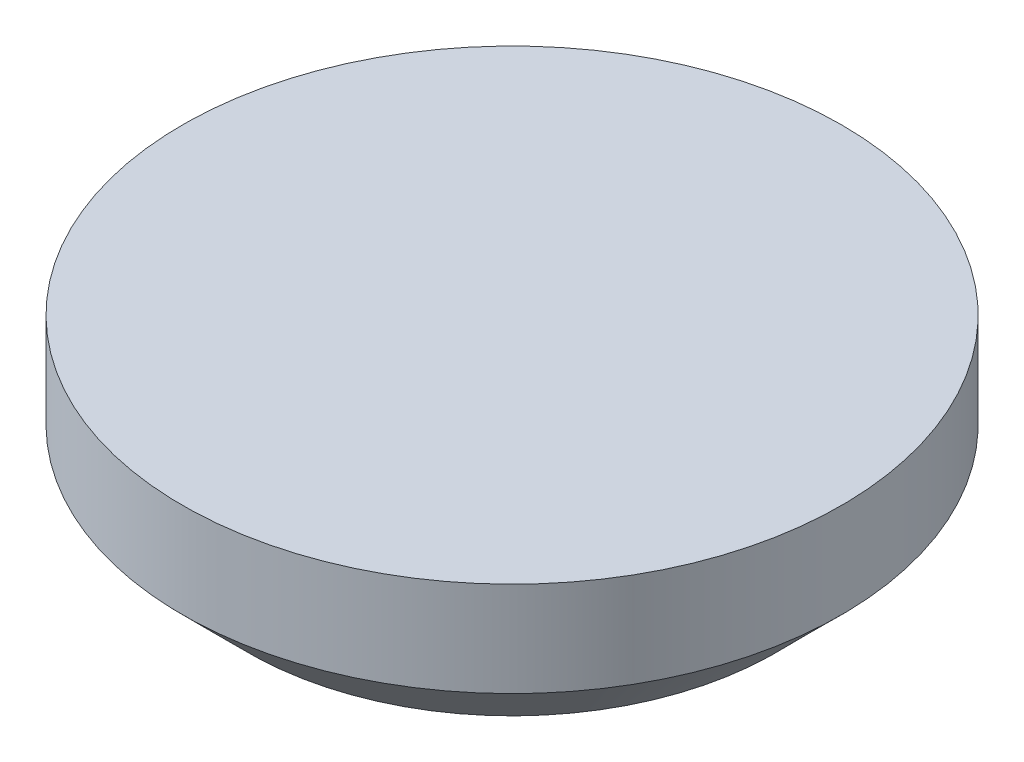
ISO-10303-21;
HEADER;
FILE_DESCRIPTION(('STEP AP214'),'2;1');
FILE_NAME('part.step','',(''),(''),'','','');
FILE_SCHEMA(('AUTOMOTIVE_DESIGN { 1 0 10303 214 1 1 1 1 }'));
ENDSEC;
DATA;
#1=APPLICATION_CONTEXT('core data for automotive mechanical design processes');
#2=APPLICATION_PROTOCOL_DEFINITION('international standard','automotive_design',2000,#1);
#3=PRODUCT_CONTEXT('',#1,'mechanical');
#4=PRODUCT('Part','Part','',(#3));
#5=PRODUCT_RELATED_PRODUCT_CATEGORY('part','',(#4));
#6=PRODUCT_DEFINITION_FORMATION('','',#4);
#7=PRODUCT_DEFINITION_CONTEXT('part definition',#1,'design');
#8=PRODUCT_DEFINITION('design','',#6,#7);
#9=PRODUCT_DEFINITION_SHAPE('','',#8);
#10=(LENGTH_UNIT() NAMED_UNIT(*) SI_UNIT(.MILLI.,.METRE.));
#11=(NAMED_UNIT(*) PLANE_ANGLE_UNIT() SI_UNIT($,.RADIAN.));
#12=(NAMED_UNIT(*) SI_UNIT($,.STERADIAN.) SOLID_ANGLE_UNIT());
#13=UNCERTAINTY_MEASURE_WITH_UNIT(LENGTH_MEASURE(1.E-05),#10,'distance_accuracy_value','');
#14=(GEOMETRIC_REPRESENTATION_CONTEXT(3) GLOBAL_UNCERTAINTY_ASSIGNED_CONTEXT((#13)) GLOBAL_UNIT_ASSIGNED_CONTEXT((#10,
#11,#12)) REPRESENTATION_CONTEXT('',''));
#15=CARTESIAN_POINT('',(0.,0.,0.));
#16=DIRECTION('',(0.,0.,1.));
#17=DIRECTION('',(1.,0.,0.));
#18=AXIS2_PLACEMENT_3D('',#15,#16,#17);
#19=CARTESIAN_POINT('',(0.,390.,0.));
#20=DIRECTION('',(0.,1.,0.));
#21=DIRECTION('',(0.,0.,1.));
#22=AXIS2_PLACEMENT_3D('',#19,#20,#21);
#23=PLANE('',#22);
#24=CARTESIAN_POINT('',(0.,390.,0.));
#25=DIRECTION('',(0.,-1.,0.));
#26=DIRECTION('',(0.,0.,-1.));
#27=AXIS2_PLACEMENT_3D('',#24,#25,#26);
#28=CIRCLE('',#27,800.);
#29=CARTESIAN_POINT('',(0.,390.,-800.));
#30=VERTEX_POINT('',#29);
#31=EDGE_CURVE('E10',#30,#30,#28,.T.);
#32=ORIENTED_EDGE('',*,*,#31,.F.);
#33=EDGE_LOOP('',(#32));
#34=FACE_BOUND('',#33,.T.);
#35=ADVANCED_FACE('F35',(#34),#23,.T.);
#36=CARTESIAN_POINT('',(0.,0.,0.));
#37=DIRECTION('',(0.,-1.,0.));
#38=DIRECTION('',(0.,0.,-1.));
#39=AXIS2_PLACEMENT_3D('',#36,#37,#38);
#40=CYLINDRICAL_SURFACE('',#39,800.);
#41=ORIENTED_EDGE('',*,*,#31,.T.);
#42=EDGE_LOOP('',(#41));
#43=FACE_BOUND('',#42,.T.);
#44=CARTESIAN_POINT('',(0.,160.,0.));
#45=DIRECTION('',(0.,-1.,0.));
#46=DIRECTION('',(0.,0.,-1.));
#47=AXIS2_PLACEMENT_3D('',#44,#45,#46);
#48=CIRCLE('',#47,800.);
#49=CARTESIAN_POINT('',(0.,160.,-800.));
#50=VERTEX_POINT('',#49);
#51=EDGE_CURVE('E41',#50,#50,#48,.T.);
#52=ORIENTED_EDGE('',*,*,#51,.F.);
#53=EDGE_LOOP('',(#52));
#54=FACE_BOUND('',#53,.T.);
#55=ADVANCED_FACE('F56',(#43,#54),#40,.T.);
#56=CARTESIAN_POINT('',(0.,0.,0.));
#57=DIRECTION('',(0.,1.,0.));
#58=DIRECTION('',(0.,0.,1.));
#59=AXIS2_PLACEMENT_3D('',#56,#57,#58);
#60=CONICAL_SURFACE('',#59,640.,0.785398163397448);
#61=ORIENTED_EDGE('',*,*,#51,.T.);
#62=EDGE_LOOP('',(#61));
#63=FACE_BOUND('',#62,.T.);
#64=CARTESIAN_POINT('',(0.,0.,0.));
#65=DIRECTION('',(0.,-1.,0.));
#66=DIRECTION('',(0.,0.,-1.));
#67=AXIS2_PLACEMENT_3D('',#64,#65,#66);
#68=CIRCLE('',#67,640.);
#69=CARTESIAN_POINT('',(0.,0.,-640.));
#70=VERTEX_POINT('',#69);
#71=EDGE_CURVE('E45',#70,#70,#68,.T.);
#72=ORIENTED_EDGE('',*,*,#71,.F.);
#73=EDGE_LOOP('',(#72));
#74=FACE_BOUND('',#73,.T.);
#75=ADVANCED_FACE('F54',(#63,#74),#60,.T.);
#76=CARTESIAN_POINT('',(640.,0.,0.));
#77=DIRECTION('',(0.,-1.,0.));
#78=DIRECTION('',(0.,0.,-1.));
#79=AXIS2_PLACEMENT_3D('',#76,#77,#78);
#80=PLANE('',#79);
#81=ORIENTED_EDGE('',*,*,#71,.T.);
#82=EDGE_LOOP('',(#81));
#83=FACE_BOUND('',#82,.T.);
#84=ADVANCED_FACE('F52',(#83),#80,.T.);
#85=CLOSED_SHELL('',(#35,#55,#75,#84));
#86=MANIFOLD_SOLID_BREP('B2',#85);
#87=ADVANCED_BREP_SHAPE_REPRESENTATION('',(#18,#86),#14);
#88=SHAPE_DEFINITION_REPRESENTATION(#9,#87);
ENDSEC;
END-ISO-10303-21;
